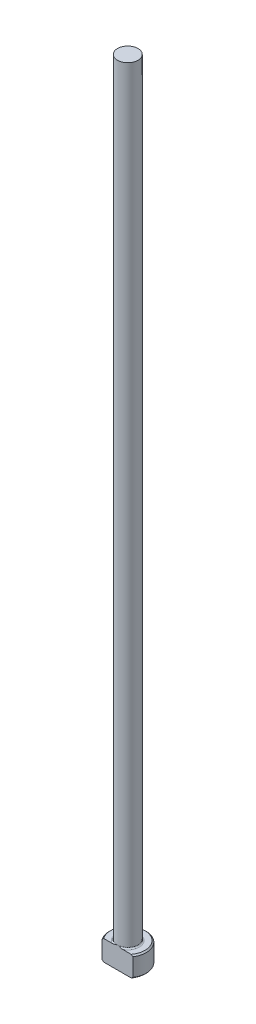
ISO-10303-21;
HEADER;
FILE_DESCRIPTION(('STEP AP214'),'2;1');
FILE_NAME('part.step','',(''),(''),'','','');
FILE_SCHEMA(('AUTOMOTIVE_DESIGN { 1 0 10303 214 1 1 1 1 }'));
ENDSEC;
DATA;
#1=APPLICATION_CONTEXT('core data for automotive mechanical design processes');
#2=APPLICATION_PROTOCOL_DEFINITION('international standard','automotive_design',2000,#1);
#3=PRODUCT_CONTEXT('',#1,'mechanical');
#4=PRODUCT('Part','Part','',(#3));
#5=PRODUCT_RELATED_PRODUCT_CATEGORY('part','',(#4));
#6=PRODUCT_DEFINITION_FORMATION('','',#4);
#7=PRODUCT_DEFINITION_CONTEXT('part definition',#1,'design');
#8=PRODUCT_DEFINITION('design','',#6,#7);
#9=PRODUCT_DEFINITION_SHAPE('','',#8);
#10=(LENGTH_UNIT() NAMED_UNIT(*) SI_UNIT(.MILLI.,.METRE.));
#11=(NAMED_UNIT(*) PLANE_ANGLE_UNIT() SI_UNIT($,.RADIAN.));
#12=(NAMED_UNIT(*) SI_UNIT($,.STERADIAN.) SOLID_ANGLE_UNIT());
#13=UNCERTAINTY_MEASURE_WITH_UNIT(LENGTH_MEASURE(1.E-05),#10,'distance_accuracy_value','');
#14=(GEOMETRIC_REPRESENTATION_CONTEXT(3) GLOBAL_UNCERTAINTY_ASSIGNED_CONTEXT((#13)) GLOBAL_UNIT_ASSIGNED_CONTEXT((#10,
#11,#12)) REPRESENTATION_CONTEXT('',''));
#15=CARTESIAN_POINT('',(0.,0.,0.));
#16=DIRECTION('',(0.,0.,1.));
#17=DIRECTION('',(1.,0.,0.));
#18=AXIS2_PLACEMENT_3D('',#15,#16,#17);
#19=CARTESIAN_POINT('',(0.,0.,0.));
#20=DIRECTION('',(0.,-1.,0.));
#21=DIRECTION('',(0.,0.,-1.));
#22=AXIS2_PLACEMENT_3D('',#19,#20,#21);
#23=PLANE('',#22);
#24=CARTESIAN_POINT('',(0.,0.,0.));
#25=DIRECTION('',(0.,-1.,0.));
#26=DIRECTION('',(0.,0.,-1.));
#27=AXIS2_PLACEMENT_3D('',#24,#25,#26);
#28=CIRCLE('',#27,3.31469999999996);
#29=CARTESIAN_POINT('',(-2.65556240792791,0.,1.98373999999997));
#30=VERTEX_POINT('',#29);
#31=CARTESIAN_POINT('',(2.65556240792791,0.,1.98373999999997));
#32=VERTEX_POINT('',#31);
#33=EDGE_CURVE('E98',#30,#32,#28,.T.);
#34=ORIENTED_EDGE('',*,*,#33,.T.);
#35=DIRECTION('',(-1.,0.,0.));
#36=VECTOR('',#35,1.);
#37=CARTESIAN_POINT('',(-2.96654602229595,0.,1.98373999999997));
#38=LINE('',#37,#36);
#39=EDGE_CURVE('E83',#32,#30,#38,.T.);
#40=ORIENTED_EDGE('',*,*,#39,.T.);
#41=EDGE_LOOP('',(#34,#40));
#42=FACE_BOUND('',#41,.T.);
#43=ADVANCED_FACE('F32',(#42),#23,.T.);
#44=CARTESIAN_POINT('',(0.,259.958771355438,0.));
#45=DIRECTION('',(0.,1.,0.));
#46=DIRECTION('',(0.,0.,1.));
#47=AXIS2_PLACEMENT_3D('',#44,#45,#46);
#48=CYLINDRICAL_SURFACE('',#47,3.56869999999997);
#49=CARTESIAN_POINT('',(0.,3.70839999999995,0.));
#50=DIRECTION('',(0.,1.,0.));
#51=DIRECTION('',(0.,0.,1.));
#52=AXIS2_PLACEMENT_3D('',#49,#50,#51);
#53=CIRCLE('',#52,3.56869999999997);
#54=CARTESIAN_POINT('',(-2.96654602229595,3.70839999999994,1.98373999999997));
#55=VERTEX_POINT('',#54);
#56=CARTESIAN_POINT('',(2.96654602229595,3.70839999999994,1.98373999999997));
#57=VERTEX_POINT('',#56);
#58=EDGE_CURVE('E104',#55,#57,#53,.F.);
#59=ORIENTED_EDGE('',*,*,#58,.T.);
#60=DIRECTION('',(0.,-1.,0.));
#61=VECTOR('',#60,1.);
#62=CARTESIAN_POINT('',(2.96654602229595,152.4,1.98373999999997));
#63=LINE('',#62,#61);
#64=CARTESIAN_POINT('',(2.96654602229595,0.254000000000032,1.98373999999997));
#65=VERTEX_POINT('',#64);
#66=EDGE_CURVE('E183',#57,#65,#63,.T.);
#67=ORIENTED_EDGE('',*,*,#66,.T.);
#68=CARTESIAN_POINT('',(0.,0.254000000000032,0.));
#69=DIRECTION('',(0.,-1.,0.));
#70=DIRECTION('',(0.,0.,-1.));
#71=AXIS2_PLACEMENT_3D('',#68,#69,#70);
#72=CIRCLE('',#71,3.56869999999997);
#73=CARTESIAN_POINT('',(-2.96654602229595,0.254000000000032,1.98373999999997));
#74=VERTEX_POINT('',#73);
#75=EDGE_CURVE('E100',#65,#74,#72,.F.);
#76=ORIENTED_EDGE('',*,*,#75,.T.);
#77=DIRECTION('',(0.,-1.,0.));
#78=VECTOR('',#77,1.);
#79=CARTESIAN_POINT('',(-2.96654602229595,152.4,1.98373999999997));
#80=LINE('',#79,#78);
#81=EDGE_CURVE('E93',#55,#74,#80,.T.);
#82=ORIENTED_EDGE('',*,*,#81,.F.);
#83=EDGE_LOOP('',(#59,#67,#76,#82));
#84=FACE_BOUND('',#83,.T.);
#85=ADVANCED_FACE('F158',(#84),#48,.T.);
#86=CARTESIAN_POINT('',(-3.56869999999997,3.9624,0.));
#87=DIRECTION('',(0.,1.,0.));
#88=DIRECTION('',(0.,0.,1.));
#89=AXIS2_PLACEMENT_3D('',#86,#87,#88);
#90=PLANE('',#89);
#91=CARTESIAN_POINT('',(0.,3.9624,0.));
#92=DIRECTION('',(0.,1.,0.));
#93=DIRECTION('',(0.,0.,1.));
#94=AXIS2_PLACEMENT_3D('',#91,#92,#93);
#95=CIRCLE('',#94,3.31469999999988);
#96=CARTESIAN_POINT('',(2.65556240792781,3.9624,1.98373999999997));
#97=VERTEX_POINT('',#96);
#98=CARTESIAN_POINT('',(-2.65556240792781,3.9624,1.98373999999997));
#99=VERTEX_POINT('',#98);
#100=EDGE_CURVE('E178',#97,#99,#95,.T.);
#101=ORIENTED_EDGE('',*,*,#100,.T.);
#102=DIRECTION('',(1.,0.,0.));
#103=VECTOR('',#102,1.);
#104=CARTESIAN_POINT('',(-3.56869999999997,3.9624,1.98373999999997));
#105=LINE('',#104,#103);
#106=CARTESIAN_POINT('',(-1.03549790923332,3.96240000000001,1.98373999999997));
#107=VERTEX_POINT('',#106);
#108=EDGE_CURVE('E57',#99,#107,#105,.T.);
#109=ORIENTED_EDGE('',*,*,#108,.T.);
#110=CARTESIAN_POINT('',(0.,3.9624,0.));
#111=DIRECTION('',(0.,1.,0.));
#112=DIRECTION('',(0.,0.,1.));
#113=AXIS2_PLACEMENT_3D('',#110,#111,#112);
#114=CIRCLE('',#113,2.23773999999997);
#115=CARTESIAN_POINT('',(1.03549790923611,3.96240000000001,1.98373999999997));
#116=VERTEX_POINT('',#115);
#117=EDGE_CURVE('E107',#107,#116,#114,.F.);
#118=ORIENTED_EDGE('',*,*,#117,.T.);
#119=EDGE_CURVE('E136',#116,#97,#105,.T.);
#120=ORIENTED_EDGE('',*,*,#119,.T.);
#121=EDGE_LOOP('',(#101,#109,#118,#120));
#122=FACE_BOUND('',#121,.T.);
#123=ADVANCED_FACE('F147',(#122),#90,.T.);
#124=CARTESIAN_POINT('',(0.,3.96239999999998,0.));
#125=DIRECTION('',(0.,-1.,0.));
#126=DIRECTION('',(0.,0.,-1.));
#127=AXIS2_PLACEMENT_3D('',#124,#125,#126);
#128=CONICAL_SURFACE('',#127,3.31469999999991,0.785398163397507);
#129=ORIENTED_EDGE('',*,*,#58,.F.);
#130=CARTESIAN_POINT('',(-6.52986193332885,0.452561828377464,1.98373999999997));
#131=CARTESIAN_POINT('',(-6.40873458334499,0.568456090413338,1.98373999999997));
#132=CARTESIAN_POINT('',(-6.28747416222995,0.684211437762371,1.98373999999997));
#133=CARTESIAN_POINT('',(-6.04463163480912,0.915385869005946,1.98373999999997));
#134=CARTESIAN_POINT('',(-5.92304952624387,1.03080495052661,1.98373999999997));
#135=CARTESIAN_POINT('',(-5.55767819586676,1.37652609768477,1.98373999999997));
#136=CARTESIAN_POINT('',(-5.31332530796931,1.60623326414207,1.98373999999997));
#137=CARTESIAN_POINT('',(-4.82149182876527,2.06424424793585,1.98373999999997));
#138=CARTESIAN_POINT('',(-4.57400269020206,2.29253892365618,1.98373999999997));
#139=CARTESIAN_POINT('',(-4.20028152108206,2.63221766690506,1.98373999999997));
#140=CARTESIAN_POINT('',(-4.07530040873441,2.7449770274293,1.98373999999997));
#141=CARTESIAN_POINT('',(-3.82427385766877,2.96930379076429,1.98373999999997));
#142=CARTESIAN_POINT('',(-3.69822843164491,3.08087120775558,1.98373999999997));
#143=CARTESIAN_POINT('',(-3.44001428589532,3.3066035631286,1.98373999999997));
#144=CARTESIAN_POINT('',(-3.3077932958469,3.42070884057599,1.98373999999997));
#145=CARTESIAN_POINT('',(-3.04138139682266,3.64664156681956,1.98373999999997));
#146=CARTESIAN_POINT('',(-2.90719023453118,3.75846871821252,1.98373999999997));
#147=CARTESIAN_POINT('',(-2.63615830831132,3.97886905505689,1.98373999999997));
#148=CARTESIAN_POINT('',(-2.49931761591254,4.08744232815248,1.98373999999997));
#149=CARTESIAN_POINT('',(-2.2219710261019,4.2997921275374,1.98373999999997));
#150=CARTESIAN_POINT('',(-2.08146612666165,4.40356993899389,1.98373999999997));
#151=CARTESIAN_POINT('',(-1.85886698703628,4.55911967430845,1.98373999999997));
#152=CARTESIAN_POINT('',(-1.77859431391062,4.61348917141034,1.98373999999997));
#153=CARTESIAN_POINT('',(-1.61606314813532,4.71915963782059,1.98373999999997));
#154=CARTESIAN_POINT('',(-1.53380502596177,4.77046117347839,1.98373999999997));
#155=CARTESIAN_POINT('',(-1.36686413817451,4.86898764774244,1.98373999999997));
#156=CARTESIAN_POINT('',(-1.2821816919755,4.91621312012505,1.98373999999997));
#157=CARTESIAN_POINT('',(-1.10999775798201,5.00512382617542,1.98373999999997));
#158=CARTESIAN_POINT('',(-1.02249748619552,5.04681141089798,1.98373999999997));
#159=CARTESIAN_POINT('',(-0.813830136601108,5.13563123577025,1.98373999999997));
#160=CARTESIAN_POINT('',(-0.691323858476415,5.17980224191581,1.98373999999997));
#161=CARTESIAN_POINT('',(-0.503703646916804,5.23128984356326,1.98373999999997));
#162=CARTESIAN_POINT('',(-0.440603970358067,5.24598141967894,1.98373999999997));
#163=CARTESIAN_POINT('',(-0.313367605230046,5.26973239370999,1.98373999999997));
#164=CARTESIAN_POINT('',(-0.249231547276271,5.2787950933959,1.98373999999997));
#165=CARTESIAN_POINT('',(-0.119629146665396,5.29081518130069,1.98373999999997));
#166=CARTESIAN_POINT('',(-0.0541560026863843,5.29370053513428,1.98373999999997));
#167=CARTESIAN_POINT('',(0.0767508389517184,5.29295512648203,1.98373999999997));
#168=CARTESIAN_POINT('',(0.142184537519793,5.28932452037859,1.98373999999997));
#169=CARTESIAN_POINT('',(0.272494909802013,5.27578328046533,1.98373999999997));
#170=CARTESIAN_POINT('',(0.337370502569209,5.26586242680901,1.98373999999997));
#171=CARTESIAN_POINT('',(0.465987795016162,5.24034027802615,1.98373999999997));
#172=CARTESIAN_POINT('',(0.529729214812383,5.224737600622,1.98373999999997));
#173=CARTESIAN_POINT('',(0.683350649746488,5.18075634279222,1.98373999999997));
#174=CARTESIAN_POINT('',(0.772481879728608,5.14977428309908,1.98373999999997));
#175=CARTESIAN_POINT('',(0.947660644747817,5.08010058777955,1.98373999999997));
#176=CARTESIAN_POINT('',(1.03370599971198,5.04140362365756,1.98373999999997));
#177=CARTESIAN_POINT('',(1.20339709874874,4.95807051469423,1.98373999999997));
#178=CARTESIAN_POINT('',(1.28702792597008,4.91340434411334,1.98373999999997));
#179=CARTESIAN_POINT('',(1.4106026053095,4.84319759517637,1.98373999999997));
#180=CARTESIAN_POINT('',(1.45147639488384,4.81926449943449,1.98373999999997));
#181=CARTESIAN_POINT('',(1.53266103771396,4.77046435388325,1.98373999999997));
#182=CARTESIAN_POINT('',(1.57297191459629,4.74559734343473,1.98373999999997));
#183=CARTESIAN_POINT('',(1.70662848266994,4.66127979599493,1.98373999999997));
#184=CARTESIAN_POINT('',(1.79884137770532,4.60003201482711,1.98373999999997));
#185=CARTESIAN_POINT('',(1.98106576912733,4.4743326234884,1.98373999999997));
#186=CARTESIAN_POINT('',(2.07107672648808,4.4098802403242,1.98373999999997));
#187=CARTESIAN_POINT('',(2.24940000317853,4.27853620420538,1.98373999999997));
#188=CARTESIAN_POINT('',(2.3377109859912,4.21164274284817,1.98373999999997));
#189=CARTESIAN_POINT('',(2.51291571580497,4.07602097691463,1.98373999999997));
#190=CARTESIAN_POINT('',(2.59980937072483,4.00729255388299,1.98373999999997));
#191=CARTESIAN_POINT('',(2.85922047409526,3.79863581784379,1.98373999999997));
#192=CARTESIAN_POINT('',(3.03001914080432,3.65657350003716,1.98373999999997));
#193=CARTESIAN_POINT('',(3.36845974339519,3.36891947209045,1.98373999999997));
#194=CARTESIAN_POINT('',(3.53610304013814,3.2233293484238,1.98373999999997));
#195=CARTESIAN_POINT('',(3.86946040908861,2.92948579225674,1.98373999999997));
#196=CARTESIAN_POINT('',(4.03517138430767,2.78122885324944,1.98373999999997));
#197=CARTESIAN_POINT('',(4.36503284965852,2.48295883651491,1.98373999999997));
#198=CARTESIAN_POINT('',(4.52918317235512,2.33294557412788,1.98373999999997));
#199=CARTESIAN_POINT('',(4.85609064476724,2.03183529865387,1.98373999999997));
#200=CARTESIAN_POINT('',(5.01884932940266,1.88073994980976,1.98373999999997));
#201=CARTESIAN_POINT('',(5.34346533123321,1.57758411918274,1.98373999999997));
#202=CARTESIAN_POINT('',(5.50532264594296,1.4255236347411,1.98373999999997));
#203=CARTESIAN_POINT('',(5.7390652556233,1.20490693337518,1.98373999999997));
#204=CARTESIAN_POINT('',(5.81123331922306,1.1366499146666,1.98373999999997));
#205=CARTESIAN_POINT('',(5.95545466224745,0.999988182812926,1.98373999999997));
#206=CARTESIAN_POINT('',(6.02750791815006,0.931583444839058,1.98373999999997));
#207=CARTESIAN_POINT('',(6.1713446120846,0.794799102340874,1.98373999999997));
#208=CARTESIAN_POINT('',(6.24312829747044,0.726419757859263,1.98373999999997));
#209=CARTESIAN_POINT('',(6.38657767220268,0.589563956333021,1.98373999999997));
#210=CARTESIAN_POINT('',(6.45824338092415,0.521087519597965,1.98373999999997));
#211=CARTESIAN_POINT('',(6.52986193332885,0.452561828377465,1.98373999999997));
#212=B_SPLINE_CURVE_WITH_KNOTS('',3,(#130,#131,#132,#133,#134,#135,#136,#137,#138,#139,#140,
#141,#142,#143,#144,#145,#146,#147,#148,#149,#150,#151,#152,#153,#154,#155,#156,#157,#158,#159,
#160,#161,#162,#163,#164,#165,#166,#167,#168,#169,#170,#171,#172,#173,#174,#175,#176,#177,#178,
#179,#180,#181,#182,#183,#184,#185,#186,#187,#188,#189,#190,#191,#192,#193,#194,#195,#196,#197,
#198,#199,#200,#201,#202,#203,#204,#205,#206,#207,#208,#209,#210,#211),.UNSPECIFIED.,.F.,.F.,(4,
2,2,2,2,2,2,2,2,2,2,2,2,2,2,2,2,2,2,2,2,2,2,2,2,2,2,2,2,2,2,2,2,2,2,2,2,2,2,2,4),(0.,
0.502921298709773,1.00584613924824,2.01195072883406,3.02203392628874,3.52701801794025,
4.0319960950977,4.55592627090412,5.07992441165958,5.60390842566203,6.12775118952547,
6.41855604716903,6.70930705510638,7.00001993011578,7.29060898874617,7.67991368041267,
7.8740658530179,8.06810403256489,8.26439284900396,8.46067695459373,8.65728078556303,
8.85393247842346,9.13651242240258,9.41928821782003,9.70354407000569,9.84563042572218,
9.98771079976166,10.319705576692,10.6517808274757,10.984107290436,11.3164552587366,
11.9828350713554,12.6489205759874,13.3159573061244,13.9830648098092,14.6493042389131,
15.315545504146,15.613547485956,15.9116042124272,16.2090224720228,16.5063857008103),.UNSPECIFIED.);
#213=EDGE_CURVE('E135',#55,#99,#212,.T.);
#214=ORIENTED_EDGE('',*,*,#213,.T.);
#215=ORIENTED_EDGE('',*,*,#100,.F.);
#216=EDGE_CURVE('E127',#97,#57,#212,.T.);
#217=ORIENTED_EDGE('',*,*,#216,.T.);
#218=EDGE_LOOP('',(#129,#214,#215,#217));
#219=FACE_BOUND('',#218,.T.);
#220=ADVANCED_FACE('F143',(#219),#128,.T.);
#221=CARTESIAN_POINT('',(0.,0.254000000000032,0.));
#222=DIRECTION('',(0.,1.,0.));
#223=DIRECTION('',(0.,0.,1.));
#224=AXIS2_PLACEMENT_3D('',#221,#222,#223);
#225=CONICAL_SURFACE('',#224,3.56869999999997,0.785398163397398);
#226=ORIENTED_EDGE('',*,*,#75,.F.);
#227=CARTESIAN_POINT('',(6.52986193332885,3.50983817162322,1.98373999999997));
#228=CARTESIAN_POINT('',(6.40873458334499,3.39394390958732,1.98373999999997));
#229=CARTESIAN_POINT('',(6.28747416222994,3.27818856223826,1.98373999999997));
#230=CARTESIAN_POINT('',(6.0446316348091,3.04701413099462,1.98373999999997));
#231=CARTESIAN_POINT('',(5.92304952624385,2.93159504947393,1.98373999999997));
#232=CARTESIAN_POINT('',(5.55767819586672,2.58587390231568,1.98373999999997));
#233=CARTESIAN_POINT('',(5.31332530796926,2.35616673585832,1.98373999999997));
#234=CARTESIAN_POINT('',(4.82149182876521,1.89815575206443,1.98373999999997));
#235=CARTESIAN_POINT('',(4.57400269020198,1.66986107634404,1.98373999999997));
#236=CARTESIAN_POINT('',(4.20028152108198,1.33018233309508,1.98373999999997));
#237=CARTESIAN_POINT('',(4.07530040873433,1.21742297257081,1.98373999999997));
#238=CARTESIAN_POINT('',(3.82427385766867,0.993096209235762,1.98373999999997));
#239=CARTESIAN_POINT('',(3.69822843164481,0.881528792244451,1.98373999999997));
#240=CARTESIAN_POINT('',(3.44001428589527,0.65579643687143,1.98373999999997));
#241=CARTESIAN_POINT('',(3.30779329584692,0.541691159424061,1.98373999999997));
#242=CARTESIAN_POINT('',(3.04138139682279,0.315758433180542,1.98373999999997));
#243=CARTESIAN_POINT('',(2.90719023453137,0.203931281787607,1.98373999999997));
#244=CARTESIAN_POINT('',(2.63615830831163,-0.0164690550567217,1.98373999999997));
#245=CARTESIAN_POINT('',(2.49931761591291,-0.125042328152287,1.98373999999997));
#246=CARTESIAN_POINT('',(2.2219710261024,-0.337392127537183,1.98373999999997));
#247=CARTESIAN_POINT('',(2.08146612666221,-0.441169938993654,1.98373999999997));
#248=CARTESIAN_POINT('',(1.85886698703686,-0.596719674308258,1.98373999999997));
#249=CARTESIAN_POINT('',(1.77859431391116,-0.651089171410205,1.98373999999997));
#250=CARTESIAN_POINT('',(1.61606314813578,-0.756759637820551,1.98373999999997));
#251=CARTESIAN_POINT('',(1.53380502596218,-0.808061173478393,1.98373999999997));
#252=CARTESIAN_POINT('',(1.36686413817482,-0.906587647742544,1.98373999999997));
#253=CARTESIAN_POINT('',(1.28218169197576,-0.953813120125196,1.98373999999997));
#254=CARTESIAN_POINT('',(1.10999775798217,-1.04272382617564,1.98373999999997));
#255=CARTESIAN_POINT('',(1.02249748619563,-1.08441141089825,1.98373999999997));
#256=CARTESIAN_POINT('',(0.813830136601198,-1.17323123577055,1.98373999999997));
#257=CARTESIAN_POINT('',(0.69132385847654,-1.21740224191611,1.98373999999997));
#258=CARTESIAN_POINT('',(0.503703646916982,-1.26888984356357,1.98373999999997));
#259=CARTESIAN_POINT('',(0.440603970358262,-1.28358141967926,1.98373999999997));
#260=CARTESIAN_POINT('',(0.313367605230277,-1.30733239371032,1.98373999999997));
#261=CARTESIAN_POINT('',(0.249231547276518,-1.31639509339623,1.98373999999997));
#262=CARTESIAN_POINT('',(0.119629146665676,-1.32841518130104,1.98373999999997));
#263=CARTESIAN_POINT('',(0.0541560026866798,-1.33130053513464,1.98373999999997));
#264=CARTESIAN_POINT('',(-0.076750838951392,-1.33055512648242,1.98373999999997));
#265=CARTESIAN_POINT('',(-0.142184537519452,-1.32692452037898,1.98373999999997));
#266=CARTESIAN_POINT('',(-0.272494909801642,-1.31338328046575,1.98373999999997));
#267=CARTESIAN_POINT('',(-0.337370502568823,-1.30346242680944,1.98373999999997));
#268=CARTESIAN_POINT('',(-0.465987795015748,-1.27794027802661,1.98373999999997));
#269=CARTESIAN_POINT('',(-0.529729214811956,-1.26233760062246,1.98373999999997));
#270=CARTESIAN_POINT('',(-0.683350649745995,-1.21835634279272,1.98373999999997));
#271=CARTESIAN_POINT('',(-0.772481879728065,-1.18737428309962,1.98373999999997));
#272=CARTESIAN_POINT('',(-0.947660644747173,-1.11770058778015,1.98373999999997));
#273=CARTESIAN_POINT('',(-1.03370599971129,-1.07900362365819,1.98373999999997));
#274=CARTESIAN_POINT('',(-1.20339709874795,-0.995670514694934,1.98373999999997));
#275=CARTESIAN_POINT('',(-1.28702792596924,-0.951004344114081,1.98373999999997));
#276=CARTESIAN_POINT('',(-1.41060260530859,-0.880797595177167,1.98373999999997));
#277=CARTESIAN_POINT('',(-1.45147639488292,-0.856864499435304,1.98373999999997));
#278=CARTESIAN_POINT('',(-1.53266103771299,-0.8080643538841,1.98373999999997));
#279=CARTESIAN_POINT('',(-1.57297191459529,-0.7831973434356,1.98373999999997));
#280=CARTESIAN_POINT('',(-1.70662848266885,-0.698879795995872,1.98373999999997));
#281=CARTESIAN_POINT('',(-1.79884137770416,-0.637632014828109,1.98373999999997));
#282=CARTESIAN_POINT('',(-1.98106576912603,-0.511932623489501,1.98373999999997));
#283=CARTESIAN_POINT('',(-2.07107672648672,-0.447480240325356,1.98373999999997));
#284=CARTESIAN_POINT('',(-2.24940000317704,-0.316136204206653,1.98373999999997));
#285=CARTESIAN_POINT('',(-2.33771098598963,-0.249242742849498,1.98373999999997));
#286=CARTESIAN_POINT('',(-2.51291571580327,-0.113620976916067,1.98373999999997));
#287=CARTESIAN_POINT('',(-2.59980937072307,-0.0448925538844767,1.98373999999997));
#288=CARTESIAN_POINT('',(-2.85922047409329,0.163764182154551,1.98373999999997));
#289=CARTESIAN_POINT('',(-3.03001914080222,0.305826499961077,1.98373999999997));
#290=CARTESIAN_POINT('',(-3.36845974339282,0.593480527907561,1.98373999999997));
#291=CARTESIAN_POINT('',(-3.53610304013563,0.739070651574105,1.98373999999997));
#292=CARTESIAN_POINT('',(-3.86946040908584,1.03291420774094,1.98373999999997));
#293=CARTESIAN_POINT('',(-4.03517138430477,1.18117114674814,1.98373999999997));
#294=CARTESIAN_POINT('',(-4.36503284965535,1.47944116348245,1.98373999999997));
#295=CARTESIAN_POINT('',(-4.52918317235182,1.62945442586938,1.98373999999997));
#296=CARTESIAN_POINT('',(-4.85609064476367,1.93056470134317,1.98373999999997));
#297=CARTESIAN_POINT('',(-5.01884932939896,2.08166005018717,1.98373999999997));
#298=CARTESIAN_POINT('',(-5.34346533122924,2.38481588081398,1.98373999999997));
#299=CARTESIAN_POINT('',(-5.50532264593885,2.53687636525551,1.98373999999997));
#300=CARTESIAN_POINT('',(-5.73906525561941,2.75749306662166,1.98373999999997));
#301=CARTESIAN_POINT('',(-5.81123331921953,2.8257500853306,1.98373999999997));
#302=CARTESIAN_POINT('',(-5.95545466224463,2.96241181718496,1.98373999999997));
#303=CARTESIAN_POINT('',(-6.02750791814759,3.03081655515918,1.98373999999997));
#304=CARTESIAN_POINT('',(-6.17134461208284,3.16760089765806,1.98373999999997));
#305=CARTESIAN_POINT('',(-6.24312829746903,3.23598024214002,1.98373999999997));
#306=CARTESIAN_POINT('',(-6.38657767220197,3.37283604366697,1.98373999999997));
#307=CARTESIAN_POINT('',(-6.45824338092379,3.44131248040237,1.98373999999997));
#308=CARTESIAN_POINT('',(-6.52986193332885,3.50983817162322,1.98373999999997));
#309=B_SPLINE_CURVE_WITH_KNOTS('',3,(#227,#228,#229,#230,#231,#232,#233,#234,#235,#236,#237,
#238,#239,#240,#241,#242,#243,#244,#245,#246,#247,#248,#249,#250,#251,#252,#253,#254,#255,#256,
#257,#258,#259,#260,#261,#262,#263,#264,#265,#266,#267,#268,#269,#270,#271,#272,#273,#274,#275,
#276,#277,#278,#279,#280,#281,#282,#283,#284,#285,#286,#287,#288,#289,#290,#291,#292,#293,#294,
#295,#296,#297,#298,#299,#300,#301,#302,#303,#304,#305,#306,#307,#308),.UNSPECIFIED.,.F.,.F.,(4,
2,2,2,2,2,2,2,2,2,2,2,2,2,2,2,2,2,2,2,2,2,2,2,2,2,2,2,2,2,2,2,2,2,2,2,2,2,2,2,4),(0.,
0.502921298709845,1.00584613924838,2.01195072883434,3.02203392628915,3.52701801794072,
4.03199609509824,4.55592627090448,5.07992441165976,5.60390842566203,6.12775118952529,
6.41855604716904,6.70930705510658,7.00001993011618,7.29060898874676,7.67991368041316,
7.87406585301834,8.06810403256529,8.26439284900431,8.46067695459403,8.65728078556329,
8.85393247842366,9.13651242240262,9.41928821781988,9.70354407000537,9.84563042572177,
9.98771079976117,10.3197055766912,10.6517808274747,10.9841072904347,11.3164552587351,
11.9828350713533,12.6489205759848,13.3159573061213,13.9830648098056,14.649304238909,
15.3155455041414,15.6135474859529,15.9116042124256,16.2090224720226,16.5063857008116),.UNSPECIFIED.);
#310=EDGE_CURVE('E86',#65,#32,#309,.T.);
#311=ORIENTED_EDGE('',*,*,#310,.T.);
#312=ORIENTED_EDGE('',*,*,#33,.F.);
#313=EDGE_CURVE('E89',#30,#74,#309,.T.);
#314=ORIENTED_EDGE('',*,*,#313,.T.);
#315=EDGE_LOOP('',(#226,#311,#312,#314));
#316=FACE_BOUND('',#315,.T.);
#317=ADVANCED_FACE('F97',(#316),#225,.T.);
#318=CARTESIAN_POINT('',(0.,4.21640000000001,0.));
#319=DIRECTION('',(0.,1.,0.));
#320=DIRECTION('',(0.,0.,1.));
#321=AXIS2_PLACEMENT_3D('',#318,#319,#320);
#322=TOROIDAL_SURFACE('',#321,2.23773999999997,0.254);
#323=CARTESIAN_POINT('',(0.,4.21640000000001,1.98373999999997));
#324=CARTESIAN_POINT('',(-4.02309577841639E-11,4.21640057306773,1.98373999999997));
#325=CARTESIAN_POINT('',(1.40828581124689E-07,4.21640114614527,1.98373999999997));
#326=CARTESIAN_POINT('',(5.73392690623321E-07,4.21640224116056,1.98373999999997));
#327=CARTESIAN_POINT('',(8.70731398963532E-07,4.21640276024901,1.98373999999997));
#328=CARTESIAN_POINT('',(1.5822579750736E-06,4.21640380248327,1.98373999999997));
#329=CARTESIAN_POINT('',(2.00604119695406E-06,4.2164043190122,1.98373999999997));
#330=CARTESIAN_POINT('',(2.91133999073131E-06,4.21640528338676,1.98373999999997));
#331=CARTESIAN_POINT('',(3.39207133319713E-06,4.21640573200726,1.98373999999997));
#332=CARTESIAN_POINT('',(5.14628593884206E-06,4.21640727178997,1.98373999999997));
#333=CARTESIAN_POINT('',(6.49332487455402E-06,4.21640828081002,1.98373999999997));
#334=CARTESIAN_POINT('',(9.24843947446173E-06,4.21641004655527,1.98373999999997));
#335=CARTESIAN_POINT('',(1.06506929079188E-05,4.21641081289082,1.98373999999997));
#336=CARTESIAN_POINT('',(1.62369385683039E-05,4.21641377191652,1.98373999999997));
#337=CARTESIAN_POINT('',(2.0499785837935E-05,4.21641582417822,1.98373999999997));
#338=CARTESIAN_POINT('',(2.88176617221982E-05,4.21641910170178,1.98373999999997));
#339=CARTESIAN_POINT('',(3.28481085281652E-05,4.21642039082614,1.98373999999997));
#340=CARTESIAN_POINT('',(5.03242637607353E-05,4.21642599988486,1.98373999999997));
#341=CARTESIAN_POINT('',(6.37475444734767E-05,4.21643035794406,1.98373999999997));
#342=CARTESIAN_POINT('',(8.86866389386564E-05,4.21643721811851,1.98373999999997));
#343=CARTESIAN_POINT('',(0.000100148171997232,4.21643990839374,1.98373999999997));
#344=CARTESIAN_POINT('',(0.000184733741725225,4.21646156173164,1.98373999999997));
#345=CARTESIAN_POINT('',(0.000255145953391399,4.21648964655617,1.98373999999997));
#346=CARTESIAN_POINT('',(0.000530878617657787,4.21659565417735,1.98373999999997));
#347=CARTESIAN_POINT('',(0.000738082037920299,4.21666677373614,1.98373999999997));
#348=CARTESIAN_POINT('',(0.00154925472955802,4.2169492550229,1.98373999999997));
#349=CARTESIAN_POINT('',(0.00215130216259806,4.21716774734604,1.98373999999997));
#350=CARTESIAN_POINT('',(0.00462988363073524,4.21806309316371,1.98373999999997));
#351=CARTESIAN_POINT('',(0.00650853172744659,4.21873189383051,1.98373999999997));
#352=CARTESIAN_POINT('',(0.0303581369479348,4.22722764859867,1.98373999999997));
#353=CARTESIAN_POINT('',(0.0523158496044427,4.23510626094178,1.98373999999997));
#354=CARTESIAN_POINT('',(0.0954269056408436,4.25047917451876,1.98373999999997));
#355=CARTESIAN_POINT('',(0.116579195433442,4.25797672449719,1.98373999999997));
#356=CARTESIAN_POINT('',(0.161458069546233,4.27377445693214,1.98373999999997));
#357=CARTESIAN_POINT('',(0.185188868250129,4.28206294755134,1.98373999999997));
#358=CARTESIAN_POINT('',(0.232964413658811,4.29853259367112,1.98373999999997));
#359=CARTESIAN_POINT('',(0.257009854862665,4.30671173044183,1.98373999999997));
#360=CARTESIAN_POINT('',(0.316193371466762,4.32648112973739,1.98373999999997));
#361=CARTESIAN_POINT('',(0.351381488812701,4.33792303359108,1.98373999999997));
#362=CARTESIAN_POINT('',(0.421152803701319,4.35974103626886,1.98373999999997));
#363=CARTESIAN_POINT('',(0.455729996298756,4.37013624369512,1.98373999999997));
#364=CARTESIAN_POINT('',(0.532487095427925,4.39200885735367,1.98373999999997));
#365=CARTESIAN_POINT('',(0.574734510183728,4.40325310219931,1.98373999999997));
#366=CARTESIAN_POINT('',(0.660038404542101,4.42385016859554,1.98373999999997));
#367=CARTESIAN_POINT('',(0.703098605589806,4.43318780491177,1.98373999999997));
#368=CARTESIAN_POINT('',(0.792838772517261,4.44980860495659,1.98373999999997));
#369=CARTESIAN_POINT('',(0.83955648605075,4.45689590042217,1.98373999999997));
#370=CARTESIAN_POINT('',(0.933305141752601,4.46701113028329,1.98373999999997));
#371=CARTESIAN_POINT('',(0.980334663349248,4.47005158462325,1.98373999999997));
#372=CARTESIAN_POINT('',(1.07363680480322,4.47068781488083,1.98373999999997));
#373=CARTESIAN_POINT('',(1.11990681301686,4.46838602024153,1.98373999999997));
#374=CARTESIAN_POINT('',(1.18820667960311,4.45949572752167,1.98373999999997));
#375=CARTESIAN_POINT('',(1.21059706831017,4.45568261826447,1.98373999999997));
#376=CARTESIAN_POINT('',(1.25489724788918,4.44592513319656,1.98373999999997));
#377=CARTESIAN_POINT('',(1.27680769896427,4.43998390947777,1.98373999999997));
#378=CARTESIAN_POINT('',(1.31298334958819,4.42779727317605,1.98373999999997));
#379=CARTESIAN_POINT('',(1.32747926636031,4.42223947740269,1.98373999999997));
#380=CARTESIAN_POINT('',(1.35590450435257,4.40970381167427,1.98373999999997));
#381=CARTESIAN_POINT('',(1.36983212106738,4.40272199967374,1.98373999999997));
#382=CARTESIAN_POINT('',(1.39685784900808,4.38707849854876,1.98373999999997));
#383=CARTESIAN_POINT('',(1.40994935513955,4.37840521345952,1.98373999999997));
#384=CARTESIAN_POINT('',(1.43467906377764,4.35918713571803,1.98373999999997));
#385=CARTESIAN_POINT('',(1.44632058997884,4.34864676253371,1.98373999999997));
#386=CARTESIAN_POINT('',(1.46405523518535,4.32920735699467,1.98373999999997));
#387=CARTESIAN_POINT('',(1.47073699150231,4.32084820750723,1.98373999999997));
#388=CARTESIAN_POINT('',(1.48274781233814,4.30319678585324,1.98373999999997));
#389=CARTESIAN_POINT('',(1.48807744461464,4.29390490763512,1.98373999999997));
#390=CARTESIAN_POINT('',(1.49706189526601,4.27440249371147,1.98373999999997));
#391=CARTESIAN_POINT('',(1.50069745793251,4.2641829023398,1.98373999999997));
#392=CARTESIAN_POINT('',(1.50584635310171,4.24322268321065,1.98373999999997));
#393=CARTESIAN_POINT('',(1.50736266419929,4.23248280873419,1.98373999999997));
#394=CARTESIAN_POINT('',(1.50805409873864,4.21251978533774,1.98373999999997));
#395=CARTESIAN_POINT('',(1.50754134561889,4.2033063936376,1.98373999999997));
#396=CARTESIAN_POINT('',(1.50490308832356,4.18511471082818,1.98373999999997));
#397=CARTESIAN_POINT('',(1.50277735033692,4.17613645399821,1.98373999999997));
#398=CARTESIAN_POINT('',(1.49719456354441,4.15900798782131,1.98373999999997));
#399=CARTESIAN_POINT('',(1.49379391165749,4.15083904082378,1.98373999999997));
#400=CARTESIAN_POINT('',(1.48586548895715,4.13507450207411,1.98373999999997));
#401=CARTESIAN_POINT('',(1.48133740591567,4.12747906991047,1.98373999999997));
#402=CARTESIAN_POINT('',(1.46862962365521,4.10893969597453,1.98373999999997));
#403=CARTESIAN_POINT('',(1.45980714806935,4.09843603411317,1.98373999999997));
#404=CARTESIAN_POINT('',(1.44060965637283,4.07895123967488,1.98373999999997));
#405=CARTESIAN_POINT('',(1.43023007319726,4.0699747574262,1.98373999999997));
#406=CARTESIAN_POINT('',(1.40223517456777,4.04875837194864,1.98373999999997));
#407=CARTESIAN_POINT('',(1.38384742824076,4.03754372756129,1.98373999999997));
#408=CARTESIAN_POINT('',(1.34565665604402,4.0180221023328,1.98373999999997));
#409=CARTESIAN_POINT('',(1.32585336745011,4.00971566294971,1.98373999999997));
#410=CARTESIAN_POINT('',(1.26986203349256,3.98996652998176,1.98373999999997));
#411=CARTESIAN_POINT('',(1.23279835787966,3.98103330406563,1.98373999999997));
#412=CARTESIAN_POINT('',(1.15741515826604,3.96843140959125,1.98373999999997));
#413=CARTESIAN_POINT('',(1.11908550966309,3.96483389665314,1.98373999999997));
#414=CARTESIAN_POINT('',(1.040510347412,3.96167833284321,1.98373999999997));
#415=CARTESIAN_POINT('',(1.00025822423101,3.96231482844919,1.98373999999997));
#416=CARTESIAN_POINT('',(0.91987811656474,3.96702722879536,1.98373999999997));
#417=CARTESIAN_POINT('',(0.879750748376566,3.97111229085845,1.98373999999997));
#418=CARTESIAN_POINT('',(0.802049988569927,3.98166551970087,1.98373999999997));
#419=CARTESIAN_POINT('',(0.764456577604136,3.98799169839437,1.98373999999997));
#420=CARTESIAN_POINT('',(0.689886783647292,4.00249311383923,1.98373999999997));
#421=CARTESIAN_POINT('',(0.652907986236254,4.0106561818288,1.98373999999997));
#422=CARTESIAN_POINT('',(0.571827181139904,4.03026785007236,1.98373999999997));
#423=CARTESIAN_POINT('',(0.527806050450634,4.04204700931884,1.98373999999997));
#424=CARTESIAN_POINT('',(0.439166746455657,4.06747597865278,1.98373999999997));
#425=CARTESIAN_POINT('',(0.394559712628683,4.0811639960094,1.98373999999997));
#426=CARTESIAN_POINT('',(0.319865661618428,4.10513097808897,1.98373999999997));
#427=CARTESIAN_POINT('',(0.289680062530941,4.11510679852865,1.98373999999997));
#428=CARTESIAN_POINT('',(0.229752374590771,4.13533754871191,1.98373999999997));
#429=CARTESIAN_POINT('',(0.200008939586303,4.14558849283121,1.98373999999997));
#430=CARTESIAN_POINT('',(0.143797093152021,4.16520591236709,1.98373999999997));
#431=CARTESIAN_POINT('',(0.117320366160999,4.17454899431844,1.98373999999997));
#432=CARTESIAN_POINT('',(0.0633624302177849,4.19374573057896,1.98373999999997));
#433=CARTESIAN_POINT('',(0.0358830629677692,4.20360493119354,1.98373999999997));
#434=CARTESIAN_POINT('',(0.00650762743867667,4.21406838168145,1.98373999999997));
#435=CARTESIAN_POINT('',(0.00462809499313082,4.21473753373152,1.98373999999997));
#436=CARTESIAN_POINT('',(0.00214930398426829,4.2156329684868,1.98373999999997));
#437=CARTESIAN_POINT('',(0.00154793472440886,4.21585121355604,1.98373999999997));
#438=CARTESIAN_POINT('',(0.00073761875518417,4.21613339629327,1.98373999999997));
#439=CARTESIAN_POINT('',(0.000530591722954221,4.21620445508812,1.98373999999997));
#440=CARTESIAN_POINT('',(0.000255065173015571,4.21631038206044,1.98373999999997));
#441=CARTESIAN_POINT('',(0.000184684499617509,4.21633845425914,1.98373999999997));
#442=CARTESIAN_POINT('',(0.000100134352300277,4.21636010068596,1.98373999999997));
#443=CARTESIAN_POINT('',(8.86750306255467E-05,4.21636279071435,1.98373999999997));
#444=CARTESIAN_POINT('',(6.37408791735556E-05,4.21636964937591,1.98373999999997));
#445=CARTESIAN_POINT('',(5.0320271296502E-05,4.21637400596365,1.98373999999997));
#446=CARTESIAN_POINT('',(3.28471072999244E-05,4.21637961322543,1.98373999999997));
#447=CARTESIAN_POINT('',(2.88169884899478E-05,4.21638090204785,1.98373999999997));
#448=CARTESIAN_POINT('',(2.04997436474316E-05,4.21638417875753,1.98373999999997));
#449=CARTESIAN_POINT('',(1.6237186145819E-05,4.21638623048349,1.98373999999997));
#450=CARTESIAN_POINT('',(1.06512202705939E-05,4.21638918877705,1.98373999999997));
#451=CARTESIAN_POINT('',(9.24899207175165E-06,4.21638995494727,1.98373999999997));
#452=CARTESIAN_POINT('',(6.49389610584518E-06,4.21639172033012,1.98373999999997));
#453=CARTESIAN_POINT('',(5.14684846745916E-06,4.21639272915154,1.98373999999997));
#454=CARTESIAN_POINT('',(3.39258419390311E-06,4.21639426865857,1.98373999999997));
#455=CARTESIAN_POINT('',(2.91183082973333E-06,4.21639471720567,1.98373999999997));
#456=CARTESIAN_POINT('',(2.00647479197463E-06,4.21639568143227,1.98373999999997));
#457=CARTESIAN_POINT('',(1.5826561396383E-06,4.21639619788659,1.98373999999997));
#458=CARTESIAN_POINT('',(8.71044274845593E-07,4.21639723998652,1.98373999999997));
#459=CARTESIAN_POINT('',(5.73657833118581E-07,4.21639775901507,1.98373999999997));
#460=CARTESIAN_POINT('',(1.40976931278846E-07,4.21639885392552,1.98373999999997));
#461=CARTESIAN_POINT('',(4.02291633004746E-11,4.21639942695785,1.98373999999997));
#462=CARTESIAN_POINT('',(0.,4.21640000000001,1.98373999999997));
#463=B_SPLINE_CURVE_WITH_KNOTS('',3,(#323,#324,#325,#326,#327,#328,#329,#330,#331,#332,#333,
#334,#335,#336,#337,#338,#339,#340,#341,#342,#343,#344,#345,#346,#347,#348,#349,#350,#351,#352,
#353,#354,#355,#356,#357,#358,#359,#360,#361,#362,#363,#364,#365,#366,#367,#368,#369,#370,#371,
#372,#373,#374,#375,#376,#377,#378,#379,#380,#381,#382,#383,#384,#385,#386,#387,#388,#389,#390,
#391,#392,#393,#394,#395,#396,#397,#398,#399,#400,#401,#402,#403,#404,#405,#406,#407,#408,#409,
#410,#411,#412,#413,#414,#415,#416,#417,#418,#419,#420,#421,#422,#423,#424,#425,#426,#427,#428,
#429,#430,#431,#432,#433,#434,#435,#436,#437,#438,#439,#440,#441,#442,#443,#444,#445,#446,#447,
#448,#449,#450,#451,#452,#453,#454,#455,#456,#457,#458,#459,#460,#461,#462),.UNSPECIFIED.,.T.,
.F.,(4,2,2,2,2,2,2,2,2,2,2,2,2,2,2,2,2,2,2,2,2,2,2,2,2,2,2,2,2,2,2,2,2,2,2,2,2,2,2,2,2,2,2,2,2,
2,2,2,2,2,2,2,2,2,2,2,2,2,2,2,2,2,2,2,2,2,2,2,2,4),(0.,1.71984197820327E-06,
3.50645578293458E-06,5.50188708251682E-06,7.4724818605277E-06,1.24982124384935E-05,
1.72883261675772E-05,3.14431062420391E-05,4.41239559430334E-05,8.64578801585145E-05,
0.000121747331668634,0.000348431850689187,0.00100625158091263,0.0029268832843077,
0.00891015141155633,0.0788889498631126,0.146215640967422,0.221624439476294,0.297819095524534,
0.408816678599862,0.517124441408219,0.648242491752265,0.780367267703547,0.92198713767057,
1.06316784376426,1.20166404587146,1.26972615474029,1.33768786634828,1.38420339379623,
1.43084947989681,1.47782736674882,1.52469550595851,1.55669718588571,1.58868540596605,
1.62102884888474,1.65332678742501,1.68086440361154,1.70840601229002,1.73485066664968,
1.76130265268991,1.80222010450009,1.84326000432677,1.90750875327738,1.97176945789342,
2.08550754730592,2.20074919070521,2.32132144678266,2.44221488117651,2.55652068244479,
2.67009044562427,2.80675839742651,2.94671648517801,3.04208779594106,3.13646648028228,
3.22069864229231,3.30827404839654,3.31426016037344,3.31617862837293,3.31683588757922,
3.31706247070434,3.3170977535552,3.31714007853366,3.31715275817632,3.31716691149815,
3.31717170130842,3.31717672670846,3.31717869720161,3.31718069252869,3.31718247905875,
3.31718419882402),.UNSPECIFIED.);
#464=CARTESIAN_POINT('',(0.,4.21640000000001,1.98373999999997));
#465=VERTEX_POINT('',#464);
#466=EDGE_CURVE('E11',#116,#465,#463,.T.);
#467=ORIENTED_EDGE('',*,*,#466,.F.);
#468=ORIENTED_EDGE('',*,*,#117,.F.);
#469=CARTESIAN_POINT('',(0.,4.21640000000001,1.98373999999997));
#470=CARTESIAN_POINT('',(4.02308316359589E-11,4.21639942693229,1.98373999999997));
#471=CARTESIAN_POINT('',(-1.40828581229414E-07,4.21639885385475,1.98373999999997));
#472=CARTESIAN_POINT('',(-5.7339269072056E-07,4.21639775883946,1.98373999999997));
#473=CARTESIAN_POINT('',(-8.70731399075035E-07,4.21639723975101,1.98373999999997));
#474=CARTESIAN_POINT('',(-1.58225797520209E-06,4.21639619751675,1.98373999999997));
#475=CARTESIAN_POINT('',(-2.00604119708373E-06,4.21639568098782,1.98373999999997));
#476=CARTESIAN_POINT('',(-2.91133999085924E-06,4.21639471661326,1.98373999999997));
#477=CARTESIAN_POINT('',(-3.39207133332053E-06,4.21639426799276,1.98373999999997));
#478=CARTESIAN_POINT('',(-5.14628593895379E-06,4.21639272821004,1.98373999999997));
#479=CARTESIAN_POINT('',(-6.49332487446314E-06,4.21639171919,1.98373999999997));
#480=CARTESIAN_POINT('',(-9.24843947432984E-06,4.21638995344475,1.98373999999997));
#481=CARTESIAN_POINT('',(-1.06506929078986E-05,4.2163891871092,1.98373999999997));
#482=CARTESIAN_POINT('',(-1.62369385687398E-05,4.2163862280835,1.98373999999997));
#483=CARTESIAN_POINT('',(-2.04997858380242E-05,4.2163841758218,1.98373999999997));
#484=CARTESIAN_POINT('',(-2.88176617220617E-05,4.21638089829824,1.98373999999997));
#485=CARTESIAN_POINT('',(-3.28481085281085E-05,4.21637960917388,1.98373999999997));
#486=CARTESIAN_POINT('',(-5.03242637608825E-05,4.21637400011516,1.98373999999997));
#487=CARTESIAN_POINT('',(-6.37475444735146E-05,4.21636964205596,1.98373999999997));
#488=CARTESIAN_POINT('',(-8.86866389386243E-05,4.21636278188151,1.98373999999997));
#489=CARTESIAN_POINT('',(-0.000100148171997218,4.21636009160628,1.98373999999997));
#490=CARTESIAN_POINT('',(-0.000184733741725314,4.21633843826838,1.98373999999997));
#491=CARTESIAN_POINT('',(-0.000255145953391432,4.21631035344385,1.98373999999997));
#492=CARTESIAN_POINT('',(-0.00053087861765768,4.21620434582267,1.98373999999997));
#493=CARTESIAN_POINT('',(-0.000738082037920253,4.21613322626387,1.98373999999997));
#494=CARTESIAN_POINT('',(-0.00154925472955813,4.21585074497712,1.98373999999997));
#495=CARTESIAN_POINT('',(-0.00215130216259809,4.21563225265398,1.98373999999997));
#496=CARTESIAN_POINT('',(-0.00462988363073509,4.21473690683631,1.98373999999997));
#497=CARTESIAN_POINT('',(-0.00650853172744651,4.21406810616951,1.98373999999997));
#498=CARTESIAN_POINT('',(-0.0303581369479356,4.20557235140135,1.98373999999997));
#499=CARTESIAN_POINT('',(-0.0523158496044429,4.19769373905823,1.98373999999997));
#500=CARTESIAN_POINT('',(-0.0954269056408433,4.18232082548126,1.98373999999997));
#501=CARTESIAN_POINT('',(-0.116579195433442,4.17482327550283,1.98373999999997));
#502=CARTESIAN_POINT('',(-0.161458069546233,4.15902554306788,1.98373999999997));
#503=CARTESIAN_POINT('',(-0.185188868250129,4.15073705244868,1.98373999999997));
#504=CARTESIAN_POINT('',(-0.232964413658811,4.1342674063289,1.98373999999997));
#505=CARTESIAN_POINT('',(-0.257009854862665,4.12608826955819,1.98373999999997));
#506=CARTESIAN_POINT('',(-0.316193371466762,4.10631887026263,1.98373999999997));
#507=CARTESIAN_POINT('',(-0.3513814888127,4.09487696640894,1.98373999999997));
#508=CARTESIAN_POINT('',(-0.421152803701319,4.07305896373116,1.98373999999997));
#509=CARTESIAN_POINT('',(-0.455729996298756,4.06266375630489,1.98373999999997));
#510=CARTESIAN_POINT('',(-0.532487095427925,4.04079114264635,1.98373999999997));
#511=CARTESIAN_POINT('',(-0.574734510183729,4.02954689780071,1.98373999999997));
#512=CARTESIAN_POINT('',(-0.660038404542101,4.00894983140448,1.98373999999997));
#513=CARTESIAN_POINT('',(-0.703098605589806,3.99961219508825,1.98373999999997));
#514=CARTESIAN_POINT('',(-0.792838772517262,3.98299139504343,1.98373999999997));
#515=CARTESIAN_POINT('',(-0.83955648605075,3.97590409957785,1.98373999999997));
#516=CARTESIAN_POINT('',(-0.933305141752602,3.96578886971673,1.98373999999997));
#517=CARTESIAN_POINT('',(-0.980334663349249,3.96274841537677,1.98373999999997));
#518=CARTESIAN_POINT('',(-1.07363680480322,3.96211218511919,1.98373999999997));
#519=CARTESIAN_POINT('',(-1.11990681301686,3.96441397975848,1.98373999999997));
#520=CARTESIAN_POINT('',(-1.18820667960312,3.97330427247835,1.98373999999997));
#521=CARTESIAN_POINT('',(-1.21059706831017,3.97711738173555,1.98373999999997));
#522=CARTESIAN_POINT('',(-1.25489724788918,3.98687486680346,1.98373999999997));
#523=CARTESIAN_POINT('',(-1.27680769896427,3.99281609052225,1.98373999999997));
#524=CARTESIAN_POINT('',(-1.31298334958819,4.00500272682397,1.98373999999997));
#525=CARTESIAN_POINT('',(-1.32747926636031,4.01056052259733,1.98373999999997));
#526=CARTESIAN_POINT('',(-1.35590450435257,4.02309618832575,1.98373999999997));
#527=CARTESIAN_POINT('',(-1.36983212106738,4.03007800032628,1.98373999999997));
#528=CARTESIAN_POINT('',(-1.39685784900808,4.04572150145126,1.98373999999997));
#529=CARTESIAN_POINT('',(-1.40994935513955,4.05439478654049,1.98373999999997));
#530=CARTESIAN_POINT('',(-1.43467906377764,4.07361286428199,1.98373999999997));
#531=CARTESIAN_POINT('',(-1.44632058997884,4.08415323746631,1.98373999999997));
#532=CARTESIAN_POINT('',(-1.46405523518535,4.10359264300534,1.98373999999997));
#533=CARTESIAN_POINT('',(-1.47073699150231,4.11195179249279,1.98373999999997));
#534=CARTESIAN_POINT('',(-1.48274781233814,4.12960321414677,1.98373999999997));
#535=CARTESIAN_POINT('',(-1.48807744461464,4.1388950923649,1.98373999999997));
#536=CARTESIAN_POINT('',(-1.49706189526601,4.15839750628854,1.98373999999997));
#537=CARTESIAN_POINT('',(-1.50069745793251,4.16861709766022,1.98373999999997));
#538=CARTESIAN_POINT('',(-1.50584635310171,4.18957731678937,1.98373999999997));
#539=CARTESIAN_POINT('',(-1.50736266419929,4.20031719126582,1.98373999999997));
#540=CARTESIAN_POINT('',(-1.50805409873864,4.22028021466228,1.98373999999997));
#541=CARTESIAN_POINT('',(-1.50754134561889,4.22949360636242,1.98373999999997));
#542=CARTESIAN_POINT('',(-1.50490308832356,4.24768528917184,1.98373999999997));
#543=CARTESIAN_POINT('',(-1.50277735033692,4.25666354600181,1.98373999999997));
#544=CARTESIAN_POINT('',(-1.49719456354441,4.27379201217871,1.98373999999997));
#545=CARTESIAN_POINT('',(-1.49379391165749,4.28196095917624,1.98373999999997));
#546=CARTESIAN_POINT('',(-1.48586548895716,4.2977254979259,1.98373999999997));
#547=CARTESIAN_POINT('',(-1.48133740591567,4.30532093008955,1.98373999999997));
#548=CARTESIAN_POINT('',(-1.46862962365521,4.32386030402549,1.98373999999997));
#549=CARTESIAN_POINT('',(-1.45980714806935,4.33436396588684,1.98373999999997));
#550=CARTESIAN_POINT('',(-1.44060965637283,4.35384876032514,1.98373999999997));
#551=CARTESIAN_POINT('',(-1.43023007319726,4.36282524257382,1.98373999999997));
#552=CARTESIAN_POINT('',(-1.40223517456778,4.38404162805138,1.98373999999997));
#553=CARTESIAN_POINT('',(-1.38384742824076,4.39525627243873,1.98373999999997));
#554=CARTESIAN_POINT('',(-1.34565665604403,4.41477789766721,1.98373999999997));
#555=CARTESIAN_POINT('',(-1.32585336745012,4.4230843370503,1.98373999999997));
#556=CARTESIAN_POINT('',(-1.26986203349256,4.44283347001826,1.98373999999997));
#557=CARTESIAN_POINT('',(-1.23279835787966,4.45176669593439,1.98373999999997));
#558=CARTESIAN_POINT('',(-1.15741515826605,4.46436859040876,1.98373999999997));
#559=CARTESIAN_POINT('',(-1.1190855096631,4.46796610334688,1.98373999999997));
#560=CARTESIAN_POINT('',(-1.04051034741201,4.4711216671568,1.98373999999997));
#561=CARTESIAN_POINT('',(-1.00025822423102,4.47048517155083,1.98373999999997));
#562=CARTESIAN_POINT('',(-0.919878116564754,4.46577277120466,1.98373999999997));
#563=CARTESIAN_POINT('',(-0.879750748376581,4.46168770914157,1.98373999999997));
#564=CARTESIAN_POINT('',(-0.802049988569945,4.45113448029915,1.98373999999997));
#565=CARTESIAN_POINT('',(-0.764456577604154,4.44480830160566,1.98373999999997));
#566=CARTESIAN_POINT('',(-0.689886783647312,4.43030688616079,1.98373999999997));
#567=CARTESIAN_POINT('',(-0.652907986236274,4.42214381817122,1.98373999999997));
#568=CARTESIAN_POINT('',(-0.571827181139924,4.40253214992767,1.98373999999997));
#569=CARTESIAN_POINT('',(-0.527806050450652,4.39075299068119,1.98373999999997));
#570=CARTESIAN_POINT('',(-0.439166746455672,4.36532402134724,1.98373999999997));
#571=CARTESIAN_POINT('',(-0.394559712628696,4.35163600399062,1.98373999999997));
#572=CARTESIAN_POINT('',(-0.319865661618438,4.32766902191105,1.98373999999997));
#573=CARTESIAN_POINT('',(-0.289680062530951,4.31769320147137,1.98373999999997));
#574=CARTESIAN_POINT('',(-0.229752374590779,4.29746245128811,1.98373999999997));
#575=CARTESIAN_POINT('',(-0.200008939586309,4.2872115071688,1.98373999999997));
#576=CARTESIAN_POINT('',(-0.143797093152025,4.26759408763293,1.98373999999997));
#577=CARTESIAN_POINT('',(-0.117320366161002,4.25825100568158,1.98373999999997));
#578=CARTESIAN_POINT('',(-0.0633624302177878,4.23905426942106,1.98373999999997));
#579=CARTESIAN_POINT('',(-0.0358830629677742,4.22919506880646,1.98373999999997));
#580=CARTESIAN_POINT('',(-0.00650762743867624,4.21873161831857,1.98373999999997));
#581=CARTESIAN_POINT('',(-0.0046280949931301,4.2180624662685,1.98373999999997));
#582=CARTESIAN_POINT('',(-0.00214930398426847,4.21716703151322,1.98373999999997));
#583=CARTESIAN_POINT('',(-0.00154793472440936,4.21694878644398,1.98373999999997));
#584=CARTESIAN_POINT('',(-0.000737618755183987,4.21666660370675,1.98373999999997));
#585=CARTESIAN_POINT('',(-0.00053059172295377,4.2165955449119,1.98373999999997));
#586=CARTESIAN_POINT('',(-0.00025506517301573,4.21648961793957,1.98373999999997));
#587=CARTESIAN_POINT('',(-0.000184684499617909,4.21646154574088,1.98373999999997));
#588=CARTESIAN_POINT('',(-0.000100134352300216,4.21643989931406,1.98373999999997));
#589=CARTESIAN_POINT('',(-8.86750306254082E-05,4.21643720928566,1.98373999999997));
#590=CARTESIAN_POINT('',(-6.37408791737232E-05,4.2164303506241,1.98373999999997));
#591=CARTESIAN_POINT('',(-5.03202712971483E-05,4.21642599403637,1.98373999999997));
#592=CARTESIAN_POINT('',(-3.28471072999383E-05,4.21642038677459,1.98373999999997));
#593=CARTESIAN_POINT('',(-2.88169884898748E-05,4.21641909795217,1.98373999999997));
#594=CARTESIAN_POINT('',(-2.04997436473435E-05,4.21641582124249,1.98373999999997));
#595=CARTESIAN_POINT('',(-1.62371861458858E-05,4.21641376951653,1.98373999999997));
#596=CARTESIAN_POINT('',(-1.06512202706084E-05,4.21641081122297,1.98373999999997));
#597=CARTESIAN_POINT('',(-9.24899207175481E-06,4.21641004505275,1.98373999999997));
#598=CARTESIAN_POINT('',(-6.49389610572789E-06,4.2164082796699,1.98373999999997));
#599=CARTESIAN_POINT('',(-5.14684846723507E-06,4.21640727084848,1.98373999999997));
#600=CARTESIAN_POINT('',(-3.39258419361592E-06,4.21640573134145,1.98373999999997));
#601=CARTESIAN_POINT('',(-2.91183082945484E-06,4.21640528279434,1.98373999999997));
#602=CARTESIAN_POINT('',(-2.00647479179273E-06,4.21640431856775,1.98373999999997));
#603=CARTESIAN_POINT('',(-1.58265613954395E-06,4.21640380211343,1.98373999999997));
#604=CARTESIAN_POINT('',(-8.7104427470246E-07,4.2164027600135,1.98373999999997));
#605=CARTESIAN_POINT('',(-5.73657832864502E-07,4.21640224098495,1.98373999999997));
#606=CARTESIAN_POINT('',(-1.40976931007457E-07,4.2164011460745,1.98373999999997));
#607=CARTESIAN_POINT('',(-4.02290371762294E-11,4.21640057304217,1.98373999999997));
#608=CARTESIAN_POINT('',(0.,4.21640000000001,1.98373999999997));
#609=B_SPLINE_CURVE_WITH_KNOTS('',3,(#469,#470,#471,#472,#473,#474,#475,#476,#477,#478,#479,
#480,#481,#482,#483,#484,#485,#486,#487,#488,#489,#490,#491,#492,#493,#494,#495,#496,#497,#498,
#499,#500,#501,#502,#503,#504,#505,#506,#507,#508,#509,#510,#511,#512,#513,#514,#515,#516,#517,
#518,#519,#520,#521,#522,#523,#524,#525,#526,#527,#528,#529,#530,#531,#532,#533,#534,#535,#536,
#537,#538,#539,#540,#541,#542,#543,#544,#545,#546,#547,#548,#549,#550,#551,#552,#553,#554,#555,
#556,#557,#558,#559,#560,#561,#562,#563,#564,#565,#566,#567,#568,#569,#570,#571,#572,#573,#574,
#575,#576,#577,#578,#579,#580,#581,#582,#583,#584,#585,#586,#587,#588,#589,#590,#591,#592,#593,
#594,#595,#596,#597,#598,#599,#600,#601,#602,#603,#604,#605,#606,#607,#608),.UNSPECIFIED.,.T.,
.F.,(4,2,2,2,2,2,2,2,2,2,2,2,2,2,2,2,2,2,2,2,2,2,2,2,2,2,2,2,2,2,2,2,2,2,2,2,2,2,2,2,2,2,2,2,2,
2,2,2,2,2,2,2,2,2,2,2,2,2,2,2,2,2,2,2,2,2,2,2,2,4),(0.,1.71984197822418E-06,
3.50645578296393E-06,5.50188708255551E-06,7.47248186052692E-06,1.24982124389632E-05,
1.72883261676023E-05,3.14431062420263E-05,4.41239559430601E-05,8.64578801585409E-05,
0.00012174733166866,0.000348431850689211,0.00100625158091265,0.00292688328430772,
0.00891015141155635,0.0788889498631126,0.146215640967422,0.221624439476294,0.297819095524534,
0.408816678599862,0.517124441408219,0.648242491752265,0.780367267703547,0.921987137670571,
1.06316784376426,1.20166404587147,1.26972615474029,1.33768786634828,1.38420339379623,
1.43084947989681,1.47782736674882,1.52469550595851,1.55669718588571,1.58868540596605,
1.62102884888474,1.65332678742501,1.68086440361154,1.70840601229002,1.73485066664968,
1.76130265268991,1.80222010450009,1.84326000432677,1.90750875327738,1.97176945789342,
2.08550754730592,2.2007491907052,2.32132144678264,2.4422148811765,2.55652068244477,
2.67009044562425,2.80675839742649,2.946716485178,3.04208779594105,3.13646648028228,
3.22069864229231,3.30827404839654,3.31426016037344,3.31617862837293,3.31683588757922,
3.31706247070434,3.3170977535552,3.31714007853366,3.31715275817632,3.31716691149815,
3.31717170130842,3.31717672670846,3.31717869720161,3.31718069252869,3.31718247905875,
3.31718419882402),.UNSPECIFIED.);
#610=EDGE_CURVE('E46',#465,#107,#609,.T.);
#611=ORIENTED_EDGE('',*,*,#610,.F.);
#612=CARTESIAN_POINT('',(0.,4.21640000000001,0.));
#613=DIRECTION('',(0.,1.,0.));
#614=DIRECTION('',(0.,0.,1.));
#615=AXIS2_PLACEMENT_3D('',#612,#613,#614);
#616=CIRCLE('',#615,1.98373999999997);
#617=EDGE_CURVE('E103',#465,#465,#616,.T.);
#618=ORIENTED_EDGE('',*,*,#617,.F.);
#619=EDGE_LOOP('',(#467,#468,#611,#618));
#620=FACE_BOUND('',#619,.T.);
#621=ADVANCED_FACE('F34',(#620),#322,.F.);
#622=CARTESIAN_POINT('',(0.,259.958771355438,0.));
#623=DIRECTION('',(0.,1.,0.));
#624=DIRECTION('',(0.,0.,1.));
#625=AXIS2_PLACEMENT_3D('',#622,#623,#624);
#626=CYLINDRICAL_SURFACE('',#625,1.98373999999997);
#627=ORIENTED_EDGE('',*,*,#617,.T.);
#628=EDGE_LOOP('',(#627));
#629=FACE_BOUND('',#628,.T.);
#630=CARTESIAN_POINT('',(0.,152.4,0.));
#631=DIRECTION('',(0.,1.,0.));
#632=DIRECTION('',(0.,0.,1.));
#633=AXIS2_PLACEMENT_3D('',#630,#631,#632);
#634=CIRCLE('',#633,1.98373999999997);
#635=CARTESIAN_POINT('',(0.,152.4,1.98373999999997));
#636=VERTEX_POINT('',#635);
#637=EDGE_CURVE('E101',#636,#636,#634,.T.);
#638=ORIENTED_EDGE('',*,*,#637,.F.);
#639=EDGE_LOOP('',(#638));
#640=FACE_BOUND('',#639,.T.);
#641=ADVANCED_FACE('F155',(#629,#640),#626,.T.);
#642=CARTESIAN_POINT('',(-1.98373999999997,152.4,0.));
#643=DIRECTION('',(0.,1.,0.));
#644=DIRECTION('',(0.,0.,1.));
#645=AXIS2_PLACEMENT_3D('',#642,#643,#644);
#646=PLANE('',#645);
#647=ORIENTED_EDGE('',*,*,#637,.T.);
#648=EDGE_LOOP('',(#647));
#649=FACE_BOUND('',#648,.T.);
#650=ADVANCED_FACE('F121',(#649),#646,.T.);
#651=CARTESIAN_POINT('',(-2.96654602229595,152.4,1.98373999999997));
#652=DIRECTION('',(0.,0.,1.));
#653=DIRECTION('',(1.,0.,0.));
#654=AXIS2_PLACEMENT_3D('',#651,#652,#653);
#655=PLANE('',#654);
#656=ORIENTED_EDGE('',*,*,#66,.F.);
#657=ORIENTED_EDGE('',*,*,#216,.F.);
#658=ORIENTED_EDGE('',*,*,#119,.F.);
#659=ORIENTED_EDGE('',*,*,#466,.T.);
#660=ORIENTED_EDGE('',*,*,#610,.T.);
#661=ORIENTED_EDGE('',*,*,#108,.F.);
#662=ORIENTED_EDGE('',*,*,#213,.F.);
#663=ORIENTED_EDGE('',*,*,#81,.T.);
#664=ORIENTED_EDGE('',*,*,#313,.F.);
#665=ORIENTED_EDGE('',*,*,#39,.F.);
#666=ORIENTED_EDGE('',*,*,#310,.F.);
#667=EDGE_LOOP('',(#656,#657,#658,#659,#660,#661,#662,#663,#664,#665,#666));
#668=FACE_BOUND('',#667,.T.);
#669=ADVANCED_FACE('F85',(#668),#655,.T.);
#670=CLOSED_SHELL('',(#43,#85,#123,#220,#317,#621,#641,#650,#669));
#671=MANIFOLD_SOLID_BREP('B2',#670);
#672=ADVANCED_BREP_SHAPE_REPRESENTATION('',(#18,#671),#14);
#673=SHAPE_DEFINITION_REPRESENTATION(#9,#672);
ENDSEC;
END-ISO-10303-21;
